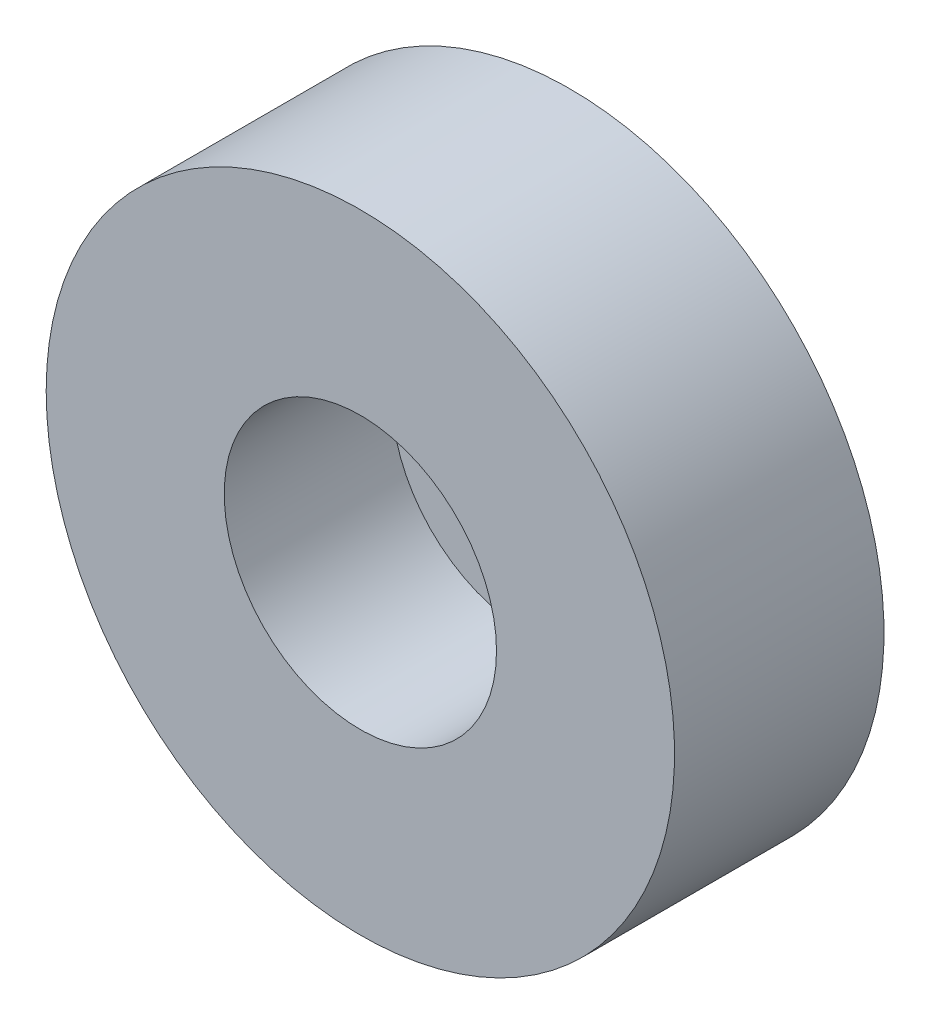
from build123d import *

# Parameters (mm, degrees)
ESQUISSE1_R             = 7.5
ESQUISSE1_R_2           = 1.5
EXTRUSION1_DEPTH        = 5
ESQUISSE2_R             = 3.25
ENL_V_MAT_EXTRU_1_DEPTH = 4


with BuildPart() as part:
    # Esquisse1 → Extrusion1 (new body)
    with BuildSketch(Plane.XY):
        with Locations(Location((0, 0, 0), (0, 0, 180))):
            Circle(ESQUISSE1_R)
        with Locations(Location((0, 0, 0), (0, 0, 180))):
            Circle(ESQUISSE1_R_2, mode=Mode.SUBTRACT)
    extrude(amount=EXTRUSION1_DEPTH)

    # Esquisse2 → Enl_v. mat.-Extru.1 (cut)
    with BuildSketch(Plane.XY.offset(5)):
        Circle(ESQUISSE2_R)
    extrude(amount=-ENL_V_MAT_EXTRU_1_DEPTH, mode=Mode.SUBTRACT)


solid = part.part
